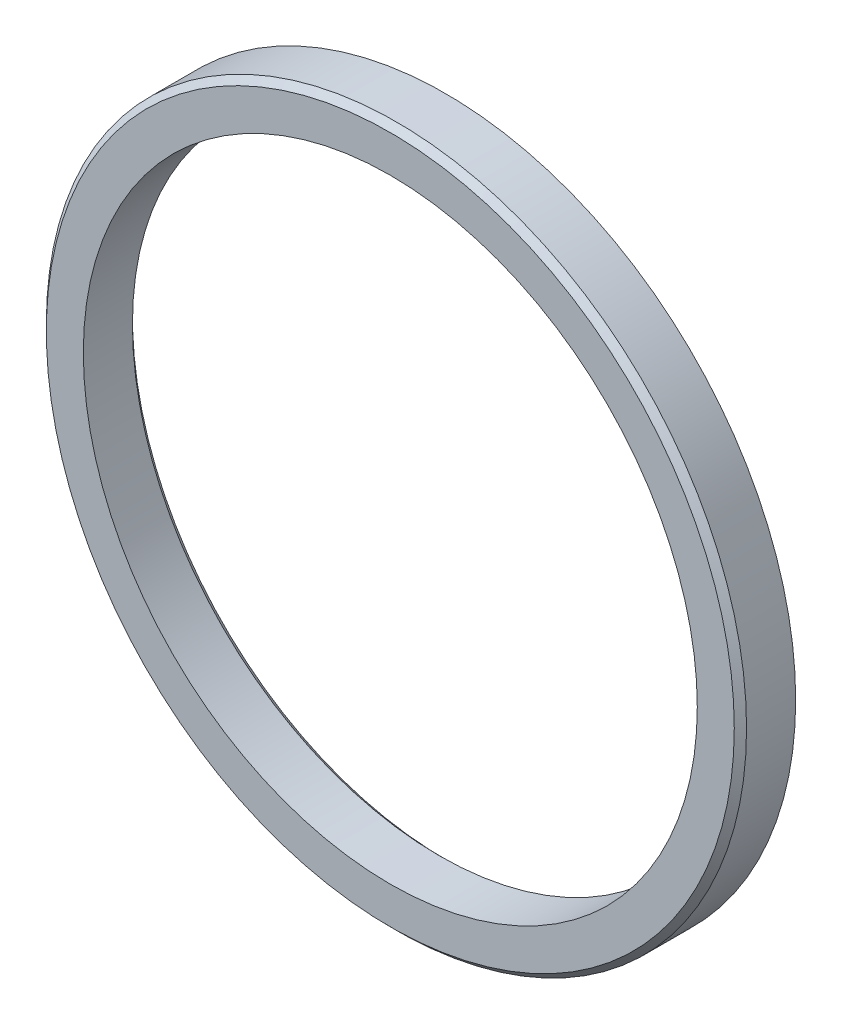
from build123d import *


with BuildPart() as part:
    # Sketch1 → Revolve1 (revolve)
    with BuildSketch(Plane(origin=(0, 0, 0), x_dir=(0, 0, -1), z_dir=(1, 0, 0)), mode=Mode.PRIVATE) as revolve1_sk:
        Polygon((-8, 100), (8, 100), (10, 102), (10, 114.05), (-6, 114.05), (-8, 112.05), align=None)
    revolve(revolve1_sk.sketch.rotate(Axis((0, 0, 66.622749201), (0, 0, -1)), 90), axis=Axis((0, 0, 66.622749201), (0, 0, -1)))


solid = part.part
